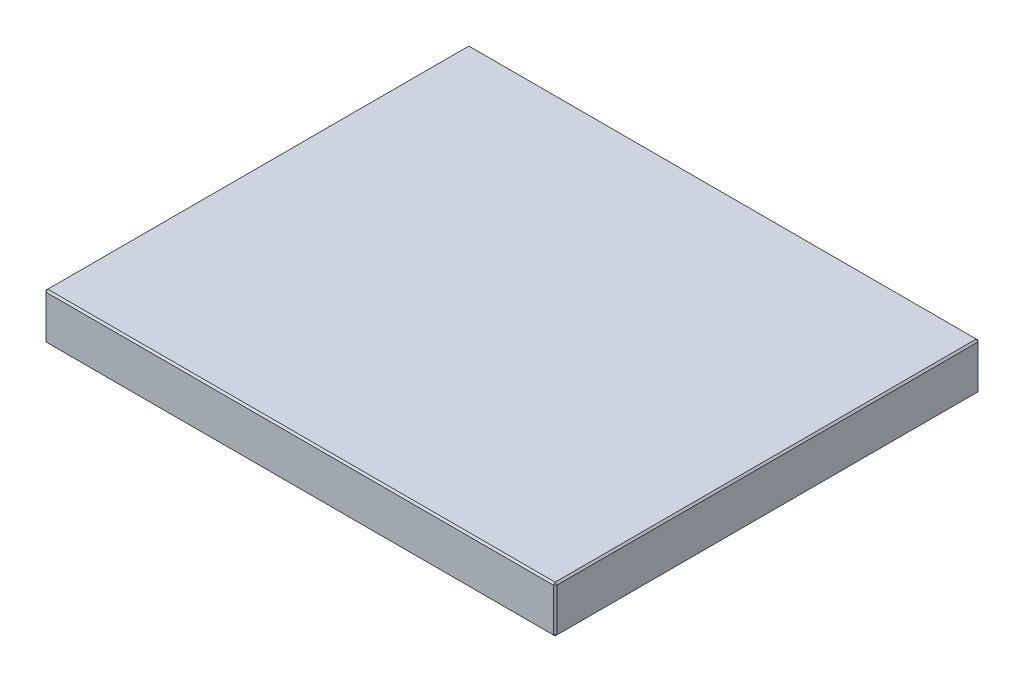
ISO-10303-21;
HEADER;
FILE_DESCRIPTION(('STEP AP214'),'2;1');
FILE_NAME('part.step','',(''),(''),'','','');
FILE_SCHEMA(('AUTOMOTIVE_DESIGN { 1 0 10303 214 1 1 1 1 }'));
ENDSEC;
DATA;
#1=APPLICATION_CONTEXT('core data for automotive mechanical design processes');
#2=APPLICATION_PROTOCOL_DEFINITION('international standard','automotive_design',2000,#1);
#3=PRODUCT_CONTEXT('',#1,'mechanical');
#4=PRODUCT('Part','Part','',(#3));
#5=PRODUCT_RELATED_PRODUCT_CATEGORY('part','',(#4));
#6=PRODUCT_DEFINITION_FORMATION('','',#4);
#7=PRODUCT_DEFINITION_CONTEXT('part definition',#1,'design');
#8=PRODUCT_DEFINITION('design','',#6,#7);
#9=PRODUCT_DEFINITION_SHAPE('','',#8);
#10=(LENGTH_UNIT() NAMED_UNIT(*) SI_UNIT(.MILLI.,.METRE.));
#11=(NAMED_UNIT(*) PLANE_ANGLE_UNIT() SI_UNIT($,.RADIAN.));
#12=(NAMED_UNIT(*) SI_UNIT($,.STERADIAN.) SOLID_ANGLE_UNIT());
#13=UNCERTAINTY_MEASURE_WITH_UNIT(LENGTH_MEASURE(1.E-05),#10,'distance_accuracy_value','');
#14=(GEOMETRIC_REPRESENTATION_CONTEXT(3) GLOBAL_UNCERTAINTY_ASSIGNED_CONTEXT((#13)) GLOBAL_UNIT_ASSIGNED_CONTEXT((#10,
#11,#12)) REPRESENTATION_CONTEXT('',''));
#15=CARTESIAN_POINT('',(0.,0.,0.));
#16=DIRECTION('',(0.,0.,1.));
#17=DIRECTION('',(1.,0.,0.));
#18=AXIS2_PLACEMENT_3D('',#15,#16,#17);
#19=CARTESIAN_POINT('',(-148.,27.,123.));
#20=DIRECTION('',(1.,0.,0.));
#21=DIRECTION('',(0.,0.,-1.));
#22=AXIS2_PLACEMENT_3D('',#19,#20,#21);
#23=PLANE('',#22);
#24=DIRECTION('',(0.,-1.,0.));
#25=VECTOR('',#24,1.);
#26=CARTESIAN_POINT('',(-148.,27.,-122.));
#27=LINE('',#26,#25);
#28=CARTESIAN_POINT('',(-148.,26.,-122.));
#29=VERTEX_POINT('',#28);
#30=CARTESIAN_POINT('',(-148.,1.,-122.));
#31=VERTEX_POINT('',#30);
#32=EDGE_CURVE('E115',#29,#31,#27,.T.);
#33=ORIENTED_EDGE('',*,*,#32,.T.);
#34=DIRECTION('',(0.,0.,1.));
#35=VECTOR('',#34,1.);
#36=CARTESIAN_POINT('',(-148.,1.,123.));
#37=LINE('',#36,#35);
#38=CARTESIAN_POINT('',(-148.,1.,122.));
#39=VERTEX_POINT('',#38);
#40=EDGE_CURVE('E111',#31,#39,#37,.T.);
#41=ORIENTED_EDGE('',*,*,#40,.T.);
#42=DIRECTION('',(0.,1.,0.));
#43=VECTOR('',#42,1.);
#44=CARTESIAN_POINT('',(-148.,27.,122.));
#45=LINE('',#44,#43);
#46=CARTESIAN_POINT('',(-148.,26.,122.));
#47=VERTEX_POINT('',#46);
#48=EDGE_CURVE('E104',#39,#47,#45,.T.);
#49=ORIENTED_EDGE('',*,*,#48,.T.);
#50=DIRECTION('',(0.,0.,-1.));
#51=VECTOR('',#50,1.);
#52=CARTESIAN_POINT('',(-148.,26.,-123.));
#53=LINE('',#52,#51);
#54=EDGE_CURVE('E108',#47,#29,#53,.T.);
#55=ORIENTED_EDGE('',*,*,#54,.T.);
#56=EDGE_LOOP('',(#33,#41,#49,#55));
#57=FACE_BOUND('',#56,.T.);
#58=ADVANCED_FACE('F16',(#57),#23,.F.);
#59=CARTESIAN_POINT('',(148.,27.,123.));
#60=DIRECTION('',(0.,0.,-1.));
#61=DIRECTION('',(-1.,0.,0.));
#62=AXIS2_PLACEMENT_3D('',#59,#60,#61);
#63=PLANE('',#62);
#64=DIRECTION('',(-1.,0.,0.));
#65=VECTOR('',#64,1.);
#66=CARTESIAN_POINT('',(-148.,26.,123.));
#67=LINE('',#66,#65);
#68=CARTESIAN_POINT('',(147.,26.,123.));
#69=VERTEX_POINT('',#68);
#70=CARTESIAN_POINT('',(-147.,26.,123.));
#71=VERTEX_POINT('',#70);
#72=EDGE_CURVE('E165',#69,#71,#67,.T.);
#73=ORIENTED_EDGE('',*,*,#72,.T.);
#74=DIRECTION('',(0.,-1.,0.));
#75=VECTOR('',#74,1.);
#76=CARTESIAN_POINT('',(-147.,27.,123.));
#77=LINE('',#76,#75);
#78=CARTESIAN_POINT('',(-147.,1.,123.));
#79=VERTEX_POINT('',#78);
#80=EDGE_CURVE('E123',#71,#79,#77,.T.);
#81=ORIENTED_EDGE('',*,*,#80,.T.);
#82=DIRECTION('',(1.,0.,0.));
#83=VECTOR('',#82,1.);
#84=CARTESIAN_POINT('',(148.,1.,123.));
#85=LINE('',#84,#83);
#86=CARTESIAN_POINT('',(147.,1.,123.));
#87=VERTEX_POINT('',#86);
#88=EDGE_CURVE('E169',#79,#87,#85,.T.);
#89=ORIENTED_EDGE('',*,*,#88,.T.);
#90=DIRECTION('',(0.,1.,0.));
#91=VECTOR('',#90,1.);
#92=CARTESIAN_POINT('',(147.,27.,123.));
#93=LINE('',#92,#91);
#94=EDGE_CURVE('E167',#87,#69,#93,.T.);
#95=ORIENTED_EDGE('',*,*,#94,.T.);
#96=EDGE_LOOP('',(#73,#81,#89,#95));
#97=FACE_BOUND('',#96,.T.);
#98=ADVANCED_FACE('F276',(#97),#63,.F.);
#99=CARTESIAN_POINT('',(148.,27.,123.));
#100=DIRECTION('',(-1.,0.,0.));
#101=DIRECTION('',(0.,0.,1.));
#102=AXIS2_PLACEMENT_3D('',#99,#100,#101);
#103=PLANE('',#102);
#104=DIRECTION('',(0.,0.,-1.));
#105=VECTOR('',#104,1.);
#106=CARTESIAN_POINT('',(148.,1.,123.));
#107=LINE('',#106,#105);
#108=CARTESIAN_POINT('',(148.,1.,122.));
#109=VERTEX_POINT('',#108);
#110=CARTESIAN_POINT('',(148.,1.,-122.));
#111=VERTEX_POINT('',#110);
#112=EDGE_CURVE('E160',#109,#111,#107,.T.);
#113=ORIENTED_EDGE('',*,*,#112,.T.);
#114=DIRECTION('',(0.,1.,0.));
#115=VECTOR('',#114,1.);
#116=CARTESIAN_POINT('',(148.,27.,-122.));
#117=LINE('',#116,#115);
#118=CARTESIAN_POINT('',(148.,26.,-122.));
#119=VERTEX_POINT('',#118);
#120=EDGE_CURVE('E162',#111,#119,#117,.T.);
#121=ORIENTED_EDGE('',*,*,#120,.T.);
#122=DIRECTION('',(0.,0.,1.));
#123=VECTOR('',#122,1.);
#124=CARTESIAN_POINT('',(148.,26.,123.));
#125=LINE('',#124,#123);
#126=CARTESIAN_POINT('',(148.,26.,122.));
#127=VERTEX_POINT('',#126);
#128=EDGE_CURVE('E156',#119,#127,#125,.T.);
#129=ORIENTED_EDGE('',*,*,#128,.T.);
#130=DIRECTION('',(0.,-1.,0.));
#131=VECTOR('',#130,1.);
#132=CARTESIAN_POINT('',(148.,27.,122.));
#133=LINE('',#132,#131);
#134=EDGE_CURVE('E158',#127,#109,#133,.T.);
#135=ORIENTED_EDGE('',*,*,#134,.T.);
#136=EDGE_LOOP('',(#113,#121,#129,#135));
#137=FACE_BOUND('',#136,.T.);
#138=ADVANCED_FACE('F255',(#137),#103,.F.);
#139=CARTESIAN_POINT('',(148.,27.,-123.));
#140=DIRECTION('',(0.,0.,1.));
#141=DIRECTION('',(1.,0.,0.));
#142=AXIS2_PLACEMENT_3D('',#139,#140,#141);
#143=PLANE('',#142);
#144=DIRECTION('',(0.,-1.,0.));
#145=VECTOR('',#144,1.);
#146=CARTESIAN_POINT('',(147.,27.,-123.));
#147=LINE('',#146,#145);
#148=CARTESIAN_POINT('',(147.,26.,-123.));
#149=VERTEX_POINT('',#148);
#150=CARTESIAN_POINT('',(147.,1.,-123.));
#151=VERTEX_POINT('',#150);
#152=EDGE_CURVE('E149',#149,#151,#147,.T.);
#153=ORIENTED_EDGE('',*,*,#152,.T.);
#154=DIRECTION('',(-1.,0.,0.));
#155=VECTOR('',#154,1.);
#156=CARTESIAN_POINT('',(148.,1.,-123.));
#157=LINE('',#156,#155);
#158=CARTESIAN_POINT('',(-147.,1.,-123.));
#159=VERTEX_POINT('',#158);
#160=EDGE_CURVE('E154',#151,#159,#157,.T.);
#161=ORIENTED_EDGE('',*,*,#160,.T.);
#162=DIRECTION('',(0.,1.,0.));
#163=VECTOR('',#162,1.);
#164=CARTESIAN_POINT('',(-147.,27.,-123.));
#165=LINE('',#164,#163);
#166=CARTESIAN_POINT('',(-147.,26.,-123.));
#167=VERTEX_POINT('',#166);
#168=EDGE_CURVE('E151',#159,#167,#165,.T.);
#169=ORIENTED_EDGE('',*,*,#168,.T.);
#170=DIRECTION('',(1.,0.,0.));
#171=VECTOR('',#170,1.);
#172=CARTESIAN_POINT('',(148.,26.,-123.));
#173=LINE('',#172,#171);
#174=EDGE_CURVE('E147',#167,#149,#173,.T.);
#175=ORIENTED_EDGE('',*,*,#174,.T.);
#176=EDGE_LOOP('',(#153,#161,#169,#175));
#177=FACE_BOUND('',#176,.T.);
#178=ADVANCED_FACE('F285',(#177),#143,.F.);
#179=CARTESIAN_POINT('',(0.,27.,0.));
#180=DIRECTION('',(0.,1.,0.));
#181=DIRECTION('',(0.,0.,1.));
#182=AXIS2_PLACEMENT_3D('',#179,#180,#181);
#183=PLANE('',#182);
#184=DIRECTION('',(0.,0.,-1.));
#185=VECTOR('',#184,1.);
#186=CARTESIAN_POINT('',(147.,27.,-123.));
#187=LINE('',#186,#185);
#188=CARTESIAN_POINT('',(147.,27.,122.));
#189=VERTEX_POINT('',#188);
#190=CARTESIAN_POINT('',(147.,27.,-122.));
#191=VERTEX_POINT('',#190);
#192=EDGE_CURVE('E25',#189,#191,#187,.T.);
#193=ORIENTED_EDGE('',*,*,#192,.T.);
#194=DIRECTION('',(-1.,0.,0.));
#195=VECTOR('',#194,1.);
#196=CARTESIAN_POINT('',(-148.,27.,-122.));
#197=LINE('',#196,#195);
#198=CARTESIAN_POINT('',(-147.,27.,-122.));
#199=VERTEX_POINT('',#198);
#200=EDGE_CURVE('E10',#191,#199,#197,.T.);
#201=ORIENTED_EDGE('',*,*,#200,.T.);
#202=DIRECTION('',(0.,0.,1.));
#203=VECTOR('',#202,1.);
#204=CARTESIAN_POINT('',(-147.,27.,123.));
#205=LINE('',#204,#203);
#206=CARTESIAN_POINT('',(-147.,27.,122.));
#207=VERTEX_POINT('',#206);
#208=EDGE_CURVE('E181',#199,#207,#205,.T.);
#209=ORIENTED_EDGE('',*,*,#208,.T.);
#210=DIRECTION('',(1.,0.,0.));
#211=VECTOR('',#210,1.);
#212=CARTESIAN_POINT('',(148.,27.,122.));
#213=LINE('',#212,#211);
#214=EDGE_CURVE('E36',#207,#189,#213,.T.);
#215=ORIENTED_EDGE('',*,*,#214,.T.);
#216=EDGE_LOOP('',(#193,#201,#209,#215));
#217=FACE_BOUND('',#216,.T.);
#218=ADVANCED_FACE('F351',(#217),#183,.T.);
#219=CARTESIAN_POINT('',(0.,0.,0.));
#220=DIRECTION('',(0.,1.,0.));
#221=DIRECTION('',(0.,0.,1.));
#222=AXIS2_PLACEMENT_3D('',#219,#220,#221);
#223=PLANE('',#222);
#224=DIRECTION('',(0.,0.,1.));
#225=VECTOR('',#224,1.);
#226=CARTESIAN_POINT('',(147.,0.,0.));
#227=LINE('',#226,#225);
#228=CARTESIAN_POINT('',(147.,0.,-122.));
#229=VERTEX_POINT('',#228);
#230=CARTESIAN_POINT('',(147.,0.,122.));
#231=VERTEX_POINT('',#230);
#232=EDGE_CURVE('E172',#229,#231,#227,.T.);
#233=ORIENTED_EDGE('',*,*,#232,.T.);
#234=DIRECTION('',(-1.,0.,0.));
#235=VECTOR('',#234,1.);
#236=CARTESIAN_POINT('',(0.,0.,122.));
#237=LINE('',#236,#235);
#238=CARTESIAN_POINT('',(-147.,0.,122.));
#239=VERTEX_POINT('',#238);
#240=EDGE_CURVE('E178',#231,#239,#237,.T.);
#241=ORIENTED_EDGE('',*,*,#240,.T.);
#242=DIRECTION('',(0.,0.,-1.));
#243=VECTOR('',#242,1.);
#244=CARTESIAN_POINT('',(-147.,0.,0.));
#245=LINE('',#244,#243);
#246=CARTESIAN_POINT('',(-147.,0.,-122.));
#247=VERTEX_POINT('',#246);
#248=EDGE_CURVE('E176',#239,#247,#245,.T.);
#249=ORIENTED_EDGE('',*,*,#248,.T.);
#250=DIRECTION('',(1.,0.,0.));
#251=VECTOR('',#250,1.);
#252=CARTESIAN_POINT('',(0.,0.,-122.));
#253=LINE('',#252,#251);
#254=EDGE_CURVE('E174',#247,#229,#253,.T.);
#255=ORIENTED_EDGE('',*,*,#254,.T.);
#256=EDGE_LOOP('',(#233,#241,#249,#255));
#257=FACE_BOUND('',#256,.T.);
#258=ADVANCED_FACE('F247',(#257),#223,.F.);
#259=CARTESIAN_POINT('',(148.,27.,122.));
#260=DIRECTION('',(-0.707106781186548,0.,-0.707106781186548));
#261=DIRECTION('',(0.,-1.,0.));
#262=AXIS2_PLACEMENT_3D('',#259,#260,#261);
#263=PLANE('',#262);
#264=DIRECTION('',(-0.707106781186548,0.,0.707106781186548));
#265=VECTOR('',#264,1.);
#266=CARTESIAN_POINT('',(147.,26.,123.));
#267=LINE('',#266,#265);
#268=EDGE_CURVE('E20',#69,#127,#267,.F.);
#269=ORIENTED_EDGE('',*,*,#268,.F.);
#270=ORIENTED_EDGE('',*,*,#94,.F.);
#271=DIRECTION('',(0.707106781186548,0.,-0.707106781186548));
#272=VECTOR('',#271,1.);
#273=CARTESIAN_POINT('',(147.,1.,123.));
#274=LINE('',#273,#272);
#275=EDGE_CURVE('E143',#109,#87,#274,.F.);
#276=ORIENTED_EDGE('',*,*,#275,.F.);
#277=ORIENTED_EDGE('',*,*,#134,.F.);
#278=EDGE_LOOP('',(#269,#270,#276,#277));
#279=FACE_BOUND('',#278,.T.);
#280=ADVANCED_FACE('F18',(#279),#263,.F.);
#281=CARTESIAN_POINT('',(147.,26.,123.));
#282=DIRECTION('',(0.577350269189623,0.577350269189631,0.577350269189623));
#283=DIRECTION('',(0.,-0.707106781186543,0.707106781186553));
#284=AXIS2_PLACEMENT_3D('',#281,#282,#283);
#285=PLANE('',#284);
#286=DIRECTION('',(0.,-0.70710678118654,0.707106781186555));
#287=VECTOR('',#286,1.);
#288=CARTESIAN_POINT('',(147.,26.,123.));
#289=LINE('',#288,#287);
#290=EDGE_CURVE('E227',#69,#189,#289,.F.);
#291=ORIENTED_EDGE('',*,*,#290,.F.);
#292=ORIENTED_EDGE('',*,*,#268,.T.);
#293=DIRECTION('',(-0.707106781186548,0.707106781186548,0.));
#294=VECTOR('',#293,1.);
#295=CARTESIAN_POINT('',(147.5,26.5,122.));
#296=LINE('',#295,#294);
#297=EDGE_CURVE('E229',#189,#127,#296,.F.);
#298=ORIENTED_EDGE('',*,*,#297,.F.);
#299=EDGE_LOOP('',(#291,#292,#298));
#300=FACE_BOUND('',#299,.T.);
#301=ADVANCED_FACE('F271',(#300),#285,.T.);
#302=CARTESIAN_POINT('',(147.,1.,123.));
#303=DIRECTION('',(0.577350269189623,-0.577350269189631,0.577350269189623));
#304=DIRECTION('',(0.,-0.707106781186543,-0.707106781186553));
#305=AXIS2_PLACEMENT_3D('',#302,#303,#304);
#306=PLANE('',#305);
#307=DIRECTION('',(-0.707106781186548,-0.707106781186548,0.));
#308=VECTOR('',#307,1.);
#309=CARTESIAN_POINT('',(147.5,0.500000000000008,122.));
#310=LINE('',#309,#308);
#311=EDGE_CURVE('E221',#109,#231,#310,.T.);
#312=ORIENTED_EDGE('',*,*,#311,.F.);
#313=ORIENTED_EDGE('',*,*,#275,.T.);
#314=DIRECTION('',(0.,0.70710678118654,0.707106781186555));
#315=VECTOR('',#314,1.);
#316=CARTESIAN_POINT('',(147.,1.,123.));
#317=LINE('',#316,#315);
#318=EDGE_CURVE('E224',#231,#87,#317,.T.);
#319=ORIENTED_EDGE('',*,*,#318,.F.);
#320=EDGE_LOOP('',(#312,#313,#319));
#321=FACE_BOUND('',#320,.T.);
#322=ADVANCED_FACE('F236',(#321),#306,.T.);
#323=CARTESIAN_POINT('',(147.,27.,0.));
#324=DIRECTION('',(0.707106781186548,0.707106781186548,0.));
#325=DIRECTION('',(0.,0.,1.));
#326=AXIS2_PLACEMENT_3D('',#323,#324,#325);
#327=PLANE('',#326);
#328=ORIENTED_EDGE('',*,*,#297,.T.);
#329=ORIENTED_EDGE('',*,*,#128,.F.);
#330=DIRECTION('',(0.707106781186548,-0.707106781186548,0.));
#331=VECTOR('',#330,1.);
#332=CARTESIAN_POINT('',(148.,26.,-122.));
#333=LINE('',#332,#331);
#334=EDGE_CURVE('E216',#191,#119,#333,.T.);
#335=ORIENTED_EDGE('',*,*,#334,.F.);
#336=ORIENTED_EDGE('',*,*,#192,.F.);
#337=EDGE_LOOP('',(#328,#329,#335,#336));
#338=FACE_BOUND('',#337,.T.);
#339=ADVANCED_FACE('F266',(#338),#327,.T.);
#340=CARTESIAN_POINT('',(0.,27.,122.));
#341=DIRECTION('',(0.,0.707106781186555,0.70710678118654));
#342=DIRECTION('',(-1.,0.,0.));
#343=AXIS2_PLACEMENT_3D('',#340,#341,#342);
#344=PLANE('',#343);
#345=ORIENTED_EDGE('',*,*,#290,.T.);
#346=ORIENTED_EDGE('',*,*,#214,.F.);
#347=DIRECTION('',(0.,0.70710678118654,-0.707106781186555));
#348=VECTOR('',#347,1.);
#349=CARTESIAN_POINT('',(-147.,26.5,122.5));
#350=LINE('',#349,#348);
#351=EDGE_CURVE('E127',#71,#207,#350,.T.);
#352=ORIENTED_EDGE('',*,*,#351,.F.);
#353=ORIENTED_EDGE('',*,*,#72,.F.);
#354=EDGE_LOOP('',(#345,#346,#352,#353));
#355=FACE_BOUND('',#354,.T.);
#356=ADVANCED_FACE('F274',(#355),#344,.T.);
#357=CARTESIAN_POINT('',(-147.,27.,123.));
#358=DIRECTION('',(0.707106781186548,0.,-0.707106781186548));
#359=DIRECTION('',(0.,-1.,0.));
#360=AXIS2_PLACEMENT_3D('',#357,#358,#359);
#361=PLANE('',#360);
#362=DIRECTION('',(0.707106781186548,0.,0.707106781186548));
#363=VECTOR('',#362,1.);
#364=CARTESIAN_POINT('',(-147.,1.,123.));
#365=LINE('',#364,#363);
#366=EDGE_CURVE('E128',#79,#39,#365,.F.);
#367=ORIENTED_EDGE('',*,*,#366,.F.);
#368=ORIENTED_EDGE('',*,*,#80,.F.);
#369=DIRECTION('',(-0.707106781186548,0.,-0.707106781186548));
#370=VECTOR('',#369,1.);
#371=CARTESIAN_POINT('',(-148.,26.,122.));
#372=LINE('',#371,#370);
#373=EDGE_CURVE('E119',#47,#71,#372,.F.);
#374=ORIENTED_EDGE('',*,*,#373,.F.);
#375=ORIENTED_EDGE('',*,*,#48,.F.);
#376=EDGE_LOOP('',(#367,#368,#374,#375));
#377=FACE_BOUND('',#376,.T.);
#378=ADVANCED_FACE('F121',(#377),#361,.F.);
#379=CARTESIAN_POINT('',(148.,1.,123.));
#380=DIRECTION('',(0.,0.707106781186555,-0.70710678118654));
#381=DIRECTION('',(1.,0.,0.));
#382=AXIS2_PLACEMENT_3D('',#379,#380,#381);
#383=PLANE('',#382);
#384=ORIENTED_EDGE('',*,*,#318,.T.);
#385=ORIENTED_EDGE('',*,*,#88,.F.);
#386=DIRECTION('',(0.,-0.70710678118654,-0.707106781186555));
#387=VECTOR('',#386,1.);
#388=CARTESIAN_POINT('',(-147.,1.,123.));
#389=LINE('',#388,#387);
#390=EDGE_CURVE('E212',#239,#79,#389,.F.);
#391=ORIENTED_EDGE('',*,*,#390,.F.);
#392=ORIENTED_EDGE('',*,*,#240,.F.);
#393=EDGE_LOOP('',(#384,#385,#391,#392));
#394=FACE_BOUND('',#393,.T.);
#395=ADVANCED_FACE('F244',(#394),#383,.F.);
#396=CARTESIAN_POINT('',(148.,1.,123.));
#397=DIRECTION('',(-0.707106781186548,0.707106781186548,0.));
#398=DIRECTION('',(0.,0.,-1.));
#399=AXIS2_PLACEMENT_3D('',#396,#397,#398);
#400=PLANE('',#399);
#401=ORIENTED_EDGE('',*,*,#311,.T.);
#402=ORIENTED_EDGE('',*,*,#232,.F.);
#403=DIRECTION('',(0.707106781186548,0.707106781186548,0.));
#404=VECTOR('',#403,1.);
#405=CARTESIAN_POINT('',(147.5,0.499999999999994,-122.));
#406=LINE('',#405,#404);
#407=EDGE_CURVE('E209',#111,#229,#406,.F.);
#408=ORIENTED_EDGE('',*,*,#407,.F.);
#409=ORIENTED_EDGE('',*,*,#112,.F.);
#410=EDGE_LOOP('',(#401,#402,#408,#409));
#411=FACE_BOUND('',#410,.T.);
#412=ADVANCED_FACE('F252',(#411),#400,.F.);
#413=CARTESIAN_POINT('',(147.,27.,-123.));
#414=DIRECTION('',(-0.707106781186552,0.,0.707106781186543));
#415=DIRECTION('',(0.,-1.,0.));
#416=AXIS2_PLACEMENT_3D('',#413,#414,#415);
#417=PLANE('',#416);
#418=DIRECTION('',(0.707106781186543,0.,0.707106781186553));
#419=VECTOR('',#418,1.);
#420=CARTESIAN_POINT('',(148.,26.,-122.));
#421=LINE('',#420,#419);
#422=EDGE_CURVE('E218',#119,#149,#421,.F.);
#423=ORIENTED_EDGE('',*,*,#422,.F.);
#424=ORIENTED_EDGE('',*,*,#120,.F.);
#425=DIRECTION('',(-0.707106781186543,0.,-0.707106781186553));
#426=VECTOR('',#425,1.);
#427=CARTESIAN_POINT('',(147.,1.,-123.));
#428=LINE('',#427,#426);
#429=EDGE_CURVE('E206',#151,#111,#428,.F.);
#430=ORIENTED_EDGE('',*,*,#429,.F.);
#431=ORIENTED_EDGE('',*,*,#152,.F.);
#432=EDGE_LOOP('',(#423,#424,#430,#431));
#433=FACE_BOUND('',#432,.T.);
#434=ADVANCED_FACE('F259',(#433),#417,.F.);
#435=CARTESIAN_POINT('',(148.,26.,-122.));
#436=DIRECTION('',(0.577350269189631,0.577350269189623,-0.577350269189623));
#437=DIRECTION('',(-0.707106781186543,0.,-0.707106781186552));
#438=AXIS2_PLACEMENT_3D('',#435,#436,#437);
#439=PLANE('',#438);
#440=ORIENTED_EDGE('',*,*,#334,.T.);
#441=ORIENTED_EDGE('',*,*,#422,.T.);
#442=DIRECTION('',(0.,0.707106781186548,0.707106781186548));
#443=VECTOR('',#442,1.);
#444=CARTESIAN_POINT('',(147.,26.5,-122.5));
#445=LINE('',#444,#443);
#446=EDGE_CURVE('E135',#191,#149,#445,.F.);
#447=ORIENTED_EDGE('',*,*,#446,.F.);
#448=EDGE_LOOP('',(#440,#441,#447));
#449=FACE_BOUND('',#448,.T.);
#450=ADVANCED_FACE('F326',(#449),#439,.T.);
#451=CARTESIAN_POINT('',(-148.,26.,122.));
#452=DIRECTION('',(-0.577350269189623,0.577350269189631,0.577350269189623));
#453=DIRECTION('',(0.,-0.707106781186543,0.707106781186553));
#454=AXIS2_PLACEMENT_3D('',#451,#452,#453);
#455=PLANE('',#454);
#456=ORIENTED_EDGE('',*,*,#373,.T.);
#457=ORIENTED_EDGE('',*,*,#351,.T.);
#458=DIRECTION('',(-0.707106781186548,-0.707106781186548,0.));
#459=VECTOR('',#458,1.);
#460=CARTESIAN_POINT('',(-148.,26.,122.));
#461=LINE('',#460,#459);
#462=EDGE_CURVE('E131',#47,#207,#461,.F.);
#463=ORIENTED_EDGE('',*,*,#462,.F.);
#464=EDGE_LOOP('',(#456,#457,#463));
#465=FACE_BOUND('',#464,.T.);
#466=ADVANCED_FACE('F132',(#465),#455,.T.);
#467=CARTESIAN_POINT('',(-147.,1.,123.));
#468=DIRECTION('',(-0.577350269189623,-0.577350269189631,0.577350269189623));
#469=DIRECTION('',(0.,-0.707106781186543,-0.707106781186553));
#470=AXIS2_PLACEMENT_3D('',#467,#468,#469);
#471=PLANE('',#470);
#472=ORIENTED_EDGE('',*,*,#390,.T.);
#473=ORIENTED_EDGE('',*,*,#366,.T.);
#474=DIRECTION('',(-0.707106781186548,0.707106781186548,0.));
#475=VECTOR('',#474,1.);
#476=CARTESIAN_POINT('',(-147.5,0.500000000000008,122.));
#477=LINE('',#476,#475);
#478=EDGE_CURVE('E136',#239,#39,#477,.T.);
#479=ORIENTED_EDGE('',*,*,#478,.F.);
#480=EDGE_LOOP('',(#472,#473,#479));
#481=FACE_BOUND('',#480,.T.);
#482=ADVANCED_FACE('F319',(#481),#471,.T.);
#483=CARTESIAN_POINT('',(147.,1.,-123.));
#484=DIRECTION('',(0.577350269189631,-0.577350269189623,-0.577350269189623));
#485=DIRECTION('',(-0.707106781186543,0.,-0.707106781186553));
#486=AXIS2_PLACEMENT_3D('',#483,#484,#485);
#487=PLANE('',#486);
#488=ORIENTED_EDGE('',*,*,#429,.T.);
#489=ORIENTED_EDGE('',*,*,#407,.T.);
#490=DIRECTION('',(0.,-0.707106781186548,0.707106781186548));
#491=VECTOR('',#490,1.);
#492=CARTESIAN_POINT('',(147.,1.,-123.));
#493=LINE('',#492,#491);
#494=EDGE_CURVE('E199',#151,#229,#493,.T.);
#495=ORIENTED_EDGE('',*,*,#494,.F.);
#496=EDGE_LOOP('',(#488,#489,#495));
#497=FACE_BOUND('',#496,.T.);
#498=ADVANCED_FACE('F315',(#497),#487,.T.);
#499=CARTESIAN_POINT('',(0.,27.,-122.));
#500=DIRECTION('',(0.,0.707106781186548,-0.707106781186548));
#501=DIRECTION('',(1.,0.,0.));
#502=AXIS2_PLACEMENT_3D('',#499,#500,#501);
#503=PLANE('',#502);
#504=ORIENTED_EDGE('',*,*,#446,.T.);
#505=ORIENTED_EDGE('',*,*,#174,.F.);
#506=DIRECTION('',(0.,-0.707106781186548,-0.707106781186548));
#507=VECTOR('',#506,1.);
#508=CARTESIAN_POINT('',(-147.,26.,-123.));
#509=LINE('',#508,#507);
#510=EDGE_CURVE('E196',#199,#167,#509,.T.);
#511=ORIENTED_EDGE('',*,*,#510,.F.);
#512=ORIENTED_EDGE('',*,*,#200,.F.);
#513=EDGE_LOOP('',(#504,#505,#511,#512));
#514=FACE_BOUND('',#513,.T.);
#515=ADVANCED_FACE('F312',(#514),#503,.T.);
#516=CARTESIAN_POINT('',(-147.,27.,0.));
#517=DIRECTION('',(-0.707106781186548,0.707106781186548,0.));
#518=DIRECTION('',(0.,0.,-1.));
#519=AXIS2_PLACEMENT_3D('',#516,#517,#518);
#520=PLANE('',#519);
#521=ORIENTED_EDGE('',*,*,#462,.T.);
#522=ORIENTED_EDGE('',*,*,#208,.F.);
#523=DIRECTION('',(0.707106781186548,0.707106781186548,0.));
#524=VECTOR('',#523,1.);
#525=CARTESIAN_POINT('',(-147.5,26.5,-122.));
#526=LINE('',#525,#524);
#527=EDGE_CURVE('E139',#29,#199,#526,.T.);
#528=ORIENTED_EDGE('',*,*,#527,.F.);
#529=ORIENTED_EDGE('',*,*,#54,.F.);
#530=EDGE_LOOP('',(#521,#522,#528,#529));
#531=FACE_BOUND('',#530,.T.);
#532=ADVANCED_FACE('F138',(#531),#520,.T.);
#533=CARTESIAN_POINT('',(-148.,1.,123.));
#534=DIRECTION('',(0.707106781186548,0.707106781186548,0.));
#535=DIRECTION('',(0.,0.,1.));
#536=AXIS2_PLACEMENT_3D('',#533,#534,#535);
#537=PLANE('',#536);
#538=ORIENTED_EDGE('',*,*,#478,.T.);
#539=ORIENTED_EDGE('',*,*,#40,.F.);
#540=DIRECTION('',(0.707106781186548,-0.707106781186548,0.));
#541=VECTOR('',#540,1.);
#542=CARTESIAN_POINT('',(-148.,1.,-122.));
#543=LINE('',#542,#541);
#544=EDGE_CURVE('E192',#247,#31,#543,.F.);
#545=ORIENTED_EDGE('',*,*,#544,.F.);
#546=ORIENTED_EDGE('',*,*,#248,.F.);
#547=EDGE_LOOP('',(#538,#539,#545,#546));
#548=FACE_BOUND('',#547,.T.);
#549=ADVANCED_FACE('F305',(#548),#537,.F.);
#550=CARTESIAN_POINT('',(148.,1.,-123.));
#551=DIRECTION('',(0.,0.707106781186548,0.707106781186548));
#552=DIRECTION('',(-1.,0.,0.));
#553=AXIS2_PLACEMENT_3D('',#550,#551,#552);
#554=PLANE('',#553);
#555=ORIENTED_EDGE('',*,*,#494,.T.);
#556=ORIENTED_EDGE('',*,*,#254,.F.);
#557=DIRECTION('',(0.,0.707106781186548,-0.707106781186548));
#558=VECTOR('',#557,1.);
#559=CARTESIAN_POINT('',(-147.,0.5,-122.5));
#560=LINE('',#559,#558);
#561=EDGE_CURVE('E189',#159,#247,#560,.F.);
#562=ORIENTED_EDGE('',*,*,#561,.F.);
#563=ORIENTED_EDGE('',*,*,#160,.F.);
#564=EDGE_LOOP('',(#555,#556,#562,#563));
#565=FACE_BOUND('',#564,.T.);
#566=ADVANCED_FACE('F301',(#565),#554,.F.);
#567=CARTESIAN_POINT('',(-147.,26.,-123.));
#568=DIRECTION('',(-0.577350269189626,0.577350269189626,-0.577350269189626));
#569=DIRECTION('',(-0.707106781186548,0.,0.707106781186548));
#570=AXIS2_PLACEMENT_3D('',#567,#568,#569);
#571=PLANE('',#570);
#572=ORIENTED_EDGE('',*,*,#527,.T.);
#573=ORIENTED_EDGE('',*,*,#510,.T.);
#574=DIRECTION('',(0.707106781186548,0.,-0.707106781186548));
#575=VECTOR('',#574,1.);
#576=CARTESIAN_POINT('',(-147.,26.,-123.));
#577=LINE('',#576,#575);
#578=EDGE_CURVE('E187',#29,#167,#577,.T.);
#579=ORIENTED_EDGE('',*,*,#578,.F.);
#580=EDGE_LOOP('',(#572,#573,#579));
#581=FACE_BOUND('',#580,.T.);
#582=ADVANCED_FACE('F297',(#581),#571,.T.);
#583=CARTESIAN_POINT('',(-148.,1.,-122.));
#584=DIRECTION('',(-0.577350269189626,-0.577350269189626,-0.577350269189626));
#585=DIRECTION('',(-0.707106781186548,0.,0.707106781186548));
#586=AXIS2_PLACEMENT_3D('',#583,#584,#585);
#587=PLANE('',#586);
#588=ORIENTED_EDGE('',*,*,#561,.T.);
#589=ORIENTED_EDGE('',*,*,#544,.T.);
#590=DIRECTION('',(-0.707106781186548,0.,0.707106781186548));
#591=VECTOR('',#590,1.);
#592=CARTESIAN_POINT('',(-148.,1.,-122.));
#593=LINE('',#592,#591);
#594=EDGE_CURVE('E185',#159,#31,#593,.T.);
#595=ORIENTED_EDGE('',*,*,#594,.F.);
#596=EDGE_LOOP('',(#588,#589,#595));
#597=FACE_BOUND('',#596,.T.);
#598=ADVANCED_FACE('F293',(#597),#587,.T.);
#599=CARTESIAN_POINT('',(-148.,27.,-122.));
#600=DIRECTION('',(0.707106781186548,0.,0.707106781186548));
#601=DIRECTION('',(0.,-1.,0.));
#602=AXIS2_PLACEMENT_3D('',#599,#600,#601);
#603=PLANE('',#602);
#604=ORIENTED_EDGE('',*,*,#578,.T.);
#605=ORIENTED_EDGE('',*,*,#168,.F.);
#606=ORIENTED_EDGE('',*,*,#594,.T.);
#607=ORIENTED_EDGE('',*,*,#32,.F.);
#608=EDGE_LOOP('',(#604,#605,#606,#607));
#609=FACE_BOUND('',#608,.T.);
#610=ADVANCED_FACE('F290',(#609),#603,.F.);
#611=CLOSED_SHELL('',(#58,#98,#138,#178,#218,#258,#280,#301,#322,#339,#356,#378,#395,#412,#434,
#450,#466,#482,#498,#515,#532,#549,#566,#582,#598,#610));
#612=MANIFOLD_SOLID_BREP('B1',#611);
#613=ADVANCED_BREP_SHAPE_REPRESENTATION('',(#18,#612),#14);
#614=SHAPE_DEFINITION_REPRESENTATION(#9,#613);
ENDSEC;
END-ISO-10303-21;
